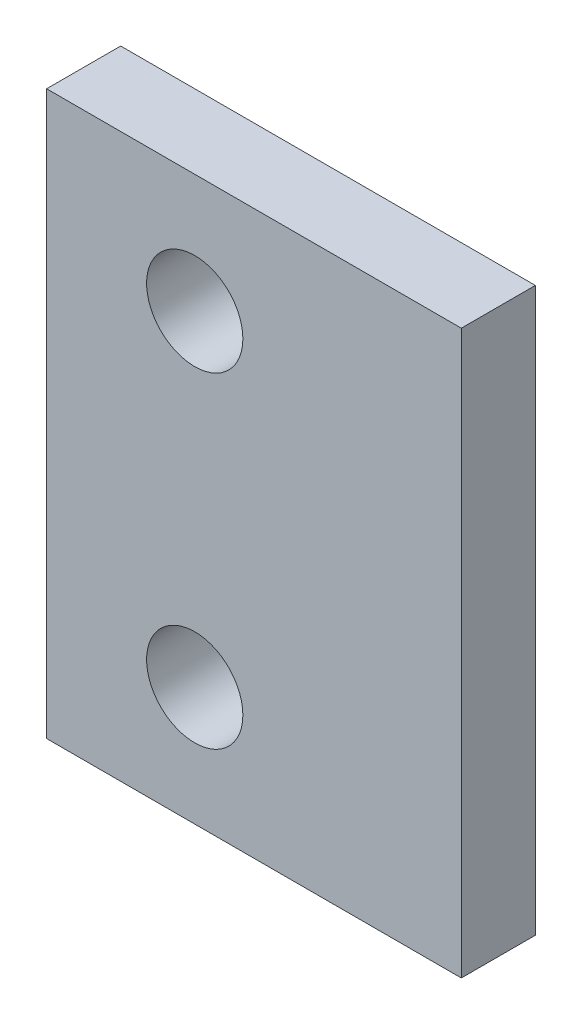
from build123d import *

# Parameters (mm, degrees)
SKETCH_1_W      = 28
SKETCH_1_H      = 38
SKETCH_1_R      = 3.25
EXTRUDE_1_DEPTH = 5


with BuildPart() as part:
    # Sketch 1 → Extrude 1 (new body)
    with BuildSketch(Plane.XY):
        with Locations((14, -19)):
            Rectangle(SKETCH_1_W, SKETCH_1_H)
        with Locations((10, -8)):
            Circle(SKETCH_1_R, mode=Mode.SUBTRACT)
        with Locations((10, -30)):
            Circle(SKETCH_1_R, mode=Mode.SUBTRACT)
    extrude(amount=EXTRUDE_1_DEPTH)


solid = part.part
